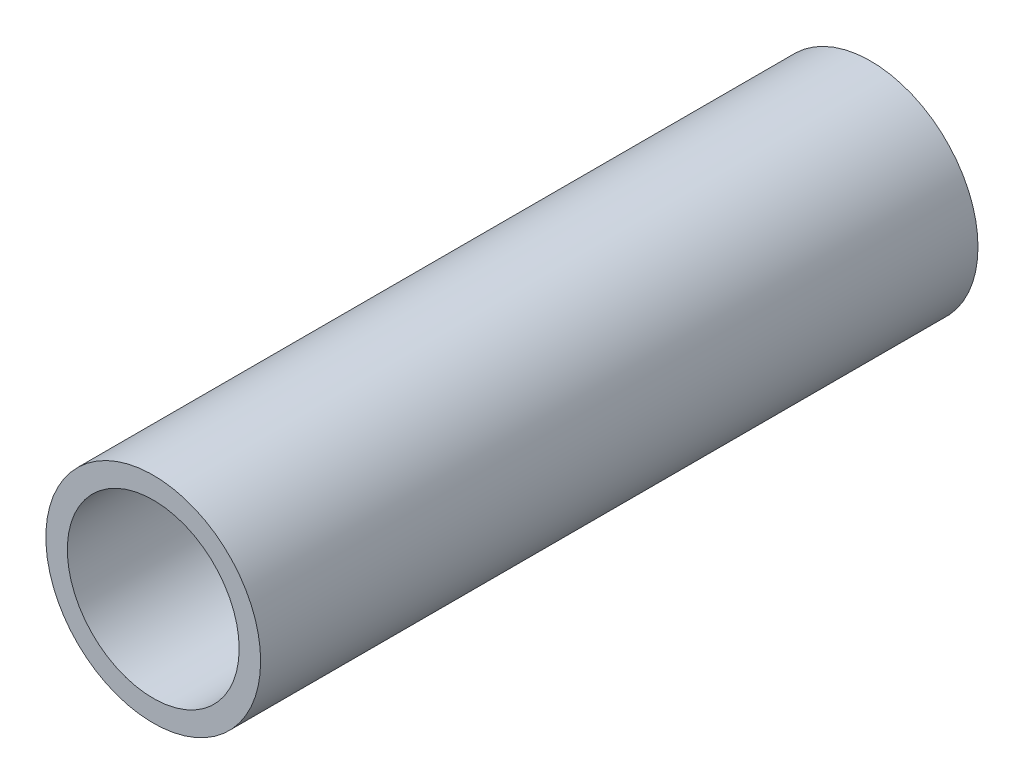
ISO-10303-21;
HEADER;
FILE_DESCRIPTION(('STEP AP214'),'2;1');
FILE_NAME('part.step','',(''),(''),'','','');
FILE_SCHEMA(('AUTOMOTIVE_DESIGN { 1 0 10303 214 1 1 1 1 }'));
ENDSEC;
DATA;
#1=APPLICATION_CONTEXT('core data for automotive mechanical design processes');
#2=APPLICATION_PROTOCOL_DEFINITION('international standard','automotive_design',2000,#1);
#3=PRODUCT_CONTEXT('',#1,'mechanical');
#4=PRODUCT('Part','Part','',(#3));
#5=PRODUCT_RELATED_PRODUCT_CATEGORY('part','',(#4));
#6=PRODUCT_DEFINITION_FORMATION('','',#4);
#7=PRODUCT_DEFINITION_CONTEXT('part definition',#1,'design');
#8=PRODUCT_DEFINITION('design','',#6,#7);
#9=PRODUCT_DEFINITION_SHAPE('','',#8);
#10=(LENGTH_UNIT() NAMED_UNIT(*) SI_UNIT(.MILLI.,.METRE.));
#11=(NAMED_UNIT(*) PLANE_ANGLE_UNIT() SI_UNIT($,.RADIAN.));
#12=(NAMED_UNIT(*) SI_UNIT($,.STERADIAN.) SOLID_ANGLE_UNIT());
#13=UNCERTAINTY_MEASURE_WITH_UNIT(LENGTH_MEASURE(1.E-05),#10,'distance_accuracy_value','');
#14=(GEOMETRIC_REPRESENTATION_CONTEXT(3) GLOBAL_UNCERTAINTY_ASSIGNED_CONTEXT((#13)) GLOBAL_UNIT_ASSIGNED_CONTEXT((#10,
#11,#12)) REPRESENTATION_CONTEXT('',''));
#15=CARTESIAN_POINT('',(0.,0.,0.));
#16=DIRECTION('',(0.,0.,1.));
#17=DIRECTION('',(1.,0.,0.));
#18=AXIS2_PLACEMENT_3D('',#15,#16,#17);
#19=CARTESIAN_POINT('',(0.,0.,83.5));
#20=DIRECTION('',(0.,0.,1.));
#21=DIRECTION('',(1.,0.,0.));
#22=AXIS2_PLACEMENT_3D('',#19,#20,#21);
#23=PLANE('',#22);
#24=CARTESIAN_POINT('',(0.,0.,83.5));
#25=DIRECTION('',(0.,0.,1.));
#26=DIRECTION('',(1.,0.,0.));
#27=AXIS2_PLACEMENT_3D('',#24,#25,#26);
#28=CIRCLE('',#27,25.);
#29=CARTESIAN_POINT('',(25.,0.,83.5));
#30=VERTEX_POINT('',#29);
#31=EDGE_CURVE('E11',#30,#30,#28,.T.);
#32=ORIENTED_EDGE('',*,*,#31,.T.);
#33=EDGE_LOOP('',(#32));
#34=FACE_BOUND('',#33,.T.);
#35=CARTESIAN_POINT('',(0.,0.,83.5));
#36=DIRECTION('',(0.,0.,1.));
#37=DIRECTION('',(1.,0.,0.));
#38=AXIS2_PLACEMENT_3D('',#35,#36,#37);
#39=CIRCLE('',#38,20.);
#40=CARTESIAN_POINT('',(20.,0.,83.5));
#41=VERTEX_POINT('',#40);
#42=EDGE_CURVE('E48',#41,#41,#39,.T.);
#43=ORIENTED_EDGE('',*,*,#42,.F.);
#44=EDGE_LOOP('',(#43));
#45=FACE_BOUND('',#44,.T.);
#46=ADVANCED_FACE('F37',(#34,#45),#23,.T.);
#47=CARTESIAN_POINT('',(0.,0.,-83.5));
#48=DIRECTION('',(0.,0.,1.));
#49=DIRECTION('',(1.,0.,0.));
#50=AXIS2_PLACEMENT_3D('',#47,#48,#49);
#51=PLANE('',#50);
#52=CARTESIAN_POINT('',(0.,0.,-83.5));
#53=DIRECTION('',(0.,0.,1.));
#54=DIRECTION('',(1.,0.,0.));
#55=AXIS2_PLACEMENT_3D('',#52,#53,#54);
#56=CIRCLE('',#55,25.);
#57=CARTESIAN_POINT('',(25.,0.,-83.5));
#58=VERTEX_POINT('',#57);
#59=EDGE_CURVE('E44',#58,#58,#56,.T.);
#60=ORIENTED_EDGE('',*,*,#59,.F.);
#61=EDGE_LOOP('',(#60));
#62=FACE_BOUND('',#61,.T.);
#63=CARTESIAN_POINT('',(0.,0.,-83.5));
#64=DIRECTION('',(0.,0.,1.));
#65=DIRECTION('',(1.,0.,0.));
#66=AXIS2_PLACEMENT_3D('',#63,#64,#65);
#67=CIRCLE('',#66,20.);
#68=CARTESIAN_POINT('',(20.,0.,-83.5));
#69=VERTEX_POINT('',#68);
#70=EDGE_CURVE('E52',#69,#69,#67,.T.);
#71=ORIENTED_EDGE('',*,*,#70,.T.);
#72=EDGE_LOOP('',(#71));
#73=FACE_BOUND('',#72,.T.);
#74=ADVANCED_FACE('F58',(#62,#73),#51,.F.);
#75=CARTESIAN_POINT('',(0.,0.,83.5));
#76=DIRECTION('',(0.,0.,-1.));
#77=DIRECTION('',(-1.,0.,0.));
#78=AXIS2_PLACEMENT_3D('',#75,#76,#77);
#79=CYLINDRICAL_SURFACE('',#78,25.);
#80=ORIENTED_EDGE('',*,*,#31,.F.);
#81=EDGE_LOOP('',(#80));
#82=FACE_BOUND('',#81,.T.);
#83=ORIENTED_EDGE('',*,*,#59,.T.);
#84=EDGE_LOOP('',(#83));
#85=FACE_BOUND('',#84,.T.);
#86=ADVANCED_FACE('F39',(#82,#85),#79,.T.);
#87=CARTESIAN_POINT('',(0.,0.,83.5));
#88=DIRECTION('',(0.,0.,-1.));
#89=DIRECTION('',(-1.,0.,0.));
#90=AXIS2_PLACEMENT_3D('',#87,#88,#89);
#91=CYLINDRICAL_SURFACE('',#90,20.);
#92=ORIENTED_EDGE('',*,*,#42,.T.);
#93=EDGE_LOOP('',(#92));
#94=FACE_BOUND('',#93,.T.);
#95=ORIENTED_EDGE('',*,*,#70,.F.);
#96=EDGE_LOOP('',(#95));
#97=FACE_BOUND('',#96,.T.);
#98=ADVANCED_FACE('F60',(#94,#97),#91,.F.);
#99=CLOSED_SHELL('',(#46,#74,#86,#98));
#100=MANIFOLD_SOLID_BREP('B2',#99);
#101=ADVANCED_BREP_SHAPE_REPRESENTATION('',(#18,#100),#14);
#102=SHAPE_DEFINITION_REPRESENTATION(#9,#101);
ENDSEC;
END-ISO-10303-21;
